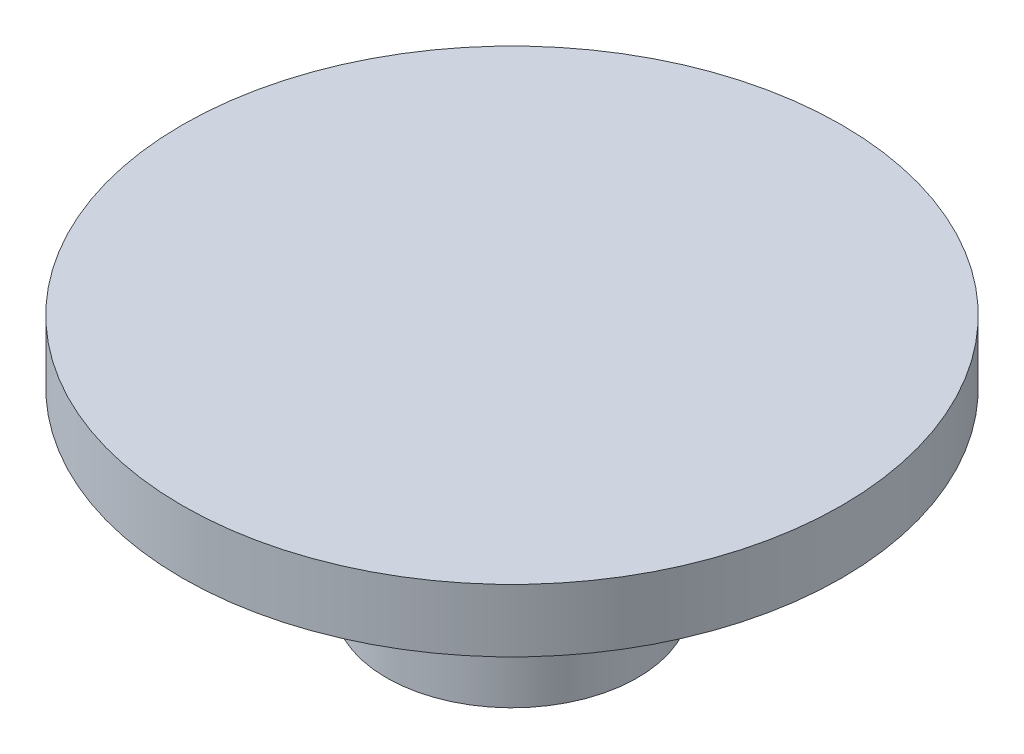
from build123d import *

# Parameters (mm, degrees)
SKETCH1_R           = 4
BOSS_EXTRUDE1_DEPTH = 6
SKETCH2_R           = 10.5
BOSS_EXTRUDE2_DEPTH = 2


with BuildPart() as part:
    # Sketch1 → Boss-Extrude1 (new body)
    with BuildSketch(Plane(origin=(0, 0, 0), x_dir=(1, 0, 0), z_dir=(0, 1, 0))):
        with Locations(Location((0, 0, 0), (0, 0, 270))):
            Circle(SKETCH1_R)
    extrude(amount=BOSS_EXTRUDE1_DEPTH)

    # Sketch2 → Boss-Extrude2 (add)
    with BuildSketch(Plane(origin=(0, 6, 0), x_dir=(1, 0, 0), z_dir=(0, 1, 0))):
        with Locations(Location((0, 0, 0), (0, 0, 270))):
            Circle(SKETCH2_R)
    extrude(amount=BOSS_EXTRUDE2_DEPTH)


solid = part.part
